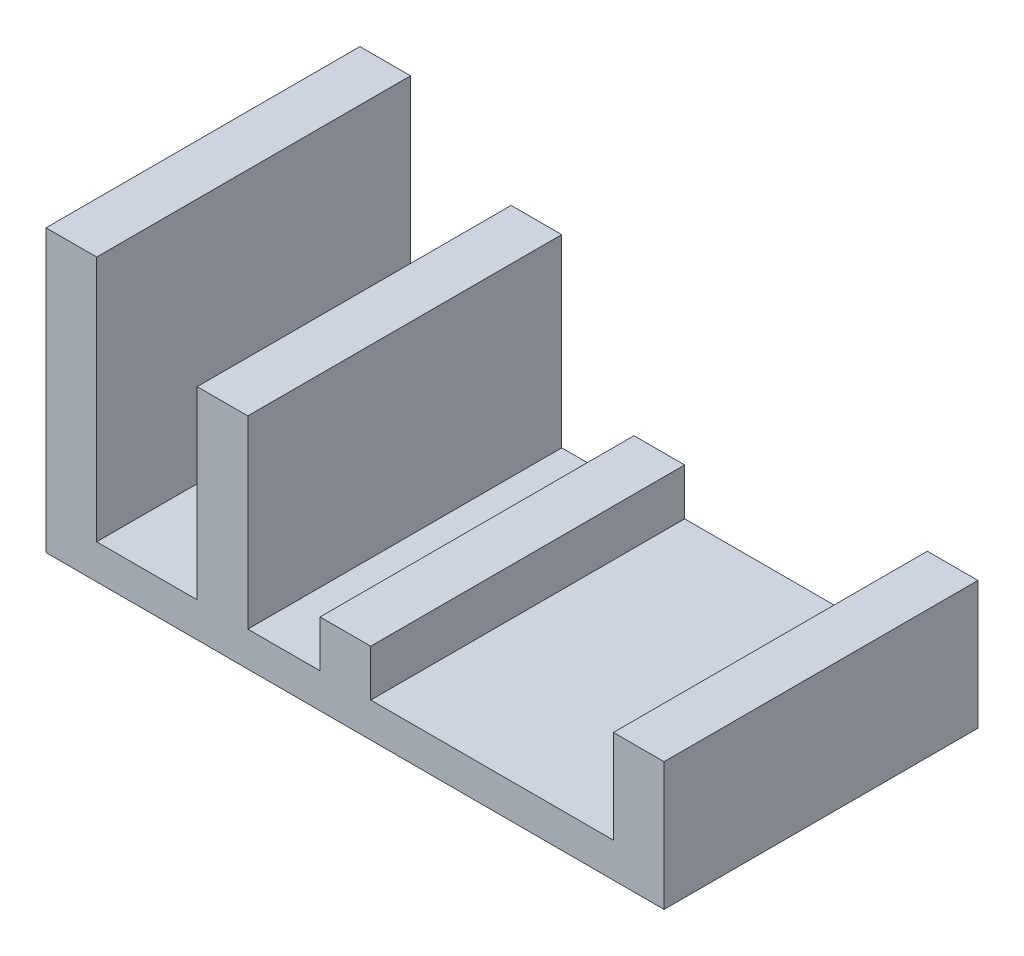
ISO-10303-21;
HEADER;
FILE_DESCRIPTION(('STEP AP214'),'2;1');
FILE_NAME('part.step','',(''),(''),'','','');
FILE_SCHEMA(('AUTOMOTIVE_DESIGN { 1 0 10303 214 1 1 1 1 }'));
ENDSEC;
DATA;
#1=APPLICATION_CONTEXT('core data for automotive mechanical design processes');
#2=APPLICATION_PROTOCOL_DEFINITION('international standard','automotive_design',2000,#1);
#3=PRODUCT_CONTEXT('',#1,'mechanical');
#4=PRODUCT('Part','Part','',(#3));
#5=PRODUCT_RELATED_PRODUCT_CATEGORY('part','',(#4));
#6=PRODUCT_DEFINITION_FORMATION('','',#4);
#7=PRODUCT_DEFINITION_CONTEXT('part definition',#1,'design');
#8=PRODUCT_DEFINITION('design','',#6,#7);
#9=PRODUCT_DEFINITION_SHAPE('','',#8);
#10=(LENGTH_UNIT() NAMED_UNIT(*) SI_UNIT(.MILLI.,.METRE.));
#11=(NAMED_UNIT(*) PLANE_ANGLE_UNIT() SI_UNIT($,.RADIAN.));
#12=(NAMED_UNIT(*) SI_UNIT($,.STERADIAN.) SOLID_ANGLE_UNIT());
#13=UNCERTAINTY_MEASURE_WITH_UNIT(LENGTH_MEASURE(1.E-05),#10,'distance_accuracy_value','');
#14=(GEOMETRIC_REPRESENTATION_CONTEXT(3) GLOBAL_UNCERTAINTY_ASSIGNED_CONTEXT((#13)) GLOBAL_UNIT_ASSIGNED_CONTEXT((#10,
#11,#12)) REPRESENTATION_CONTEXT('',''));
#15=CARTESIAN_POINT('',(0.,0.,0.));
#16=DIRECTION('',(0.,0.,1.));
#17=DIRECTION('',(1.,0.,0.));
#18=AXIS2_PLACEMENT_3D('',#15,#16,#17);
#19=CARTESIAN_POINT('',(12.1527001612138,67.4845492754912,37.6594941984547));
#20=DIRECTION('',(0.,-1.,0.));
#21=DIRECTION('',(0.,0.,-1.));
#22=AXIS2_PLACEMENT_3D('',#19,#20,#21);
#23=PLANE('',#22);
#24=DIRECTION('',(-1.,0.,0.));
#25=VECTOR('',#24,1.);
#26=CARTESIAN_POINT('',(12.1527001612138,67.4845492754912,-37.6594941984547));
#27=LINE('',#26,#25);
#28=CARTESIAN_POINT('',(12.1527001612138,67.4845492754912,-37.6594941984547));
#29=VERTEX_POINT('',#28);
#30=CARTESIAN_POINT('',(0.,67.4845492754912,-37.6594941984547));
#31=VERTEX_POINT('',#30);
#32=EDGE_CURVE('E148',#29,#31,#27,.T.);
#33=ORIENTED_EDGE('',*,*,#32,.T.);
#34=DIRECTION('',(0.,0.,-1.));
#35=VECTOR('',#34,1.);
#36=CARTESIAN_POINT('',(0.,67.4845492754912,37.6594941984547));
#37=LINE('',#36,#35);
#38=CARTESIAN_POINT('',(0.,67.4845492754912,37.6594941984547));
#39=VERTEX_POINT('',#38);
#40=EDGE_CURVE('E11',#39,#31,#37,.T.);
#41=ORIENTED_EDGE('',*,*,#40,.F.);
#42=DIRECTION('',(-1.,0.,0.));
#43=VECTOR('',#42,1.);
#44=CARTESIAN_POINT('',(12.1527001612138,67.4845492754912,37.6594941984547));
#45=LINE('',#44,#43);
#46=CARTESIAN_POINT('',(12.1527001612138,67.4845492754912,37.6594941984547));
#47=VERTEX_POINT('',#46);
#48=EDGE_CURVE('E191',#47,#39,#45,.T.);
#49=ORIENTED_EDGE('',*,*,#48,.F.);
#50=DIRECTION('',(0.,0.,-1.));
#51=VECTOR('',#50,1.);
#52=CARTESIAN_POINT('',(12.1527001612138,67.4845492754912,37.6594941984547));
#53=LINE('',#52,#51);
#54=EDGE_CURVE('E161',#47,#29,#53,.T.);
#55=ORIENTED_EDGE('',*,*,#54,.T.);
#56=EDGE_LOOP('',(#33,#41,#49,#55));
#57=FACE_BOUND('',#56,.T.);
#58=ADVANCED_FACE('F32',(#57),#23,.F.);
#59=CARTESIAN_POINT('',(0.,67.4845492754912,37.6594941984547));
#60=DIRECTION('',(1.,0.,0.));
#61=DIRECTION('',(0.,0.,-1.));
#62=AXIS2_PLACEMENT_3D('',#59,#60,#61);
#63=PLANE('',#62);
#64=DIRECTION('',(0.,-1.,0.));
#65=VECTOR('',#64,1.);
#66=CARTESIAN_POINT('',(0.,67.4845492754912,-37.6594941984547));
#67=LINE('',#66,#65);
#68=CARTESIAN_POINT('',(0.,0.,-37.6594941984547));
#69=VERTEX_POINT('',#68);
#70=EDGE_CURVE('E144',#31,#69,#67,.T.);
#71=ORIENTED_EDGE('',*,*,#70,.T.);
#72=DIRECTION('',(0.,0.,-1.));
#73=VECTOR('',#72,1.);
#74=CARTESIAN_POINT('',(0.,0.,37.6594941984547));
#75=LINE('',#74,#73);
#76=CARTESIAN_POINT('',(0.,0.,37.6594941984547));
#77=VERTEX_POINT('',#76);
#78=EDGE_CURVE('E39',#77,#69,#75,.T.);
#79=ORIENTED_EDGE('',*,*,#78,.F.);
#80=DIRECTION('',(0.,-1.,0.));
#81=VECTOR('',#80,1.);
#82=CARTESIAN_POINT('',(0.,67.4845492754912,37.6594941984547));
#83=LINE('',#82,#81);
#84=EDGE_CURVE('E157',#39,#77,#83,.T.);
#85=ORIENTED_EDGE('',*,*,#84,.F.);
#86=ORIENTED_EDGE('',*,*,#40,.T.);
#87=EDGE_LOOP('',(#71,#79,#85,#86));
#88=FACE_BOUND('',#87,.T.);
#89=ADVANCED_FACE('F156',(#88),#63,.F.);
#90=CARTESIAN_POINT('',(0.,0.,37.6594941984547));
#91=DIRECTION('',(0.,1.,0.));
#92=DIRECTION('',(0.,0.,1.));
#93=AXIS2_PLACEMENT_3D('',#90,#91,#92);
#94=PLANE('',#93);
#95=DIRECTION('',(1.,0.,0.));
#96=VECTOR('',#95,1.);
#97=CARTESIAN_POINT('',(0.,0.,-37.6594941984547));
#98=LINE('',#97,#96);
#99=CARTESIAN_POINT('',(148.290313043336,0.,-37.6594941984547));
#100=VERTEX_POINT('',#99);
#101=EDGE_CURVE('E150',#69,#100,#98,.T.);
#102=ORIENTED_EDGE('',*,*,#101,.T.);
#103=DIRECTION('',(0.,0.,-1.));
#104=VECTOR('',#103,1.);
#105=CARTESIAN_POINT('',(148.290313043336,0.,37.6594941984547));
#106=LINE('',#105,#104);
#107=CARTESIAN_POINT('',(148.290313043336,0.,37.6594941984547));
#108=VERTEX_POINT('',#107);
#109=EDGE_CURVE('E257',#108,#100,#106,.T.);
#110=ORIENTED_EDGE('',*,*,#109,.F.);
#111=DIRECTION('',(1.,0.,0.));
#112=VECTOR('',#111,1.);
#113=CARTESIAN_POINT('',(0.,0.,37.6594941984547));
#114=LINE('',#113,#112);
#115=EDGE_CURVE('E194',#77,#108,#114,.T.);
#116=ORIENTED_EDGE('',*,*,#115,.F.);
#117=ORIENTED_EDGE('',*,*,#78,.T.);
#118=EDGE_LOOP('',(#102,#110,#116,#117));
#119=FACE_BOUND('',#118,.T.);
#120=ADVANCED_FACE('F261',(#119),#94,.F.);
#121=CARTESIAN_POINT('',(148.290313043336,0.,37.6594941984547));
#122=DIRECTION('',(-1.,0.,0.));
#123=DIRECTION('',(0.,0.,1.));
#124=AXIS2_PLACEMENT_3D('',#121,#122,#123);
#125=PLANE('',#124);
#126=DIRECTION('',(0.,1.,0.));
#127=VECTOR('',#126,1.);
#128=CARTESIAN_POINT('',(148.290313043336,0.,-37.6594941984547));
#129=LINE('',#128,#127);
#130=CARTESIAN_POINT('',(148.290313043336,30.7015583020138,-37.6594941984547));
#131=VERTEX_POINT('',#130);
#132=EDGE_CURVE('E165',#100,#131,#129,.T.);
#133=ORIENTED_EDGE('',*,*,#132,.T.);
#134=DIRECTION('',(0.,0.,-1.));
#135=VECTOR('',#134,1.);
#136=CARTESIAN_POINT('',(148.290313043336,30.7015583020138,37.6594941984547));
#137=LINE('',#136,#135);
#138=CARTESIAN_POINT('',(148.290313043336,30.7015583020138,37.6594941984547));
#139=VERTEX_POINT('',#138);
#140=EDGE_CURVE('E254',#139,#131,#137,.T.);
#141=ORIENTED_EDGE('',*,*,#140,.F.);
#142=DIRECTION('',(0.,1.,0.));
#143=VECTOR('',#142,1.);
#144=CARTESIAN_POINT('',(148.290313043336,0.,37.6594941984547));
#145=LINE('',#144,#143);
#146=EDGE_CURVE('E196',#108,#139,#145,.T.);
#147=ORIENTED_EDGE('',*,*,#146,.F.);
#148=ORIENTED_EDGE('',*,*,#109,.T.);
#149=EDGE_LOOP('',(#133,#141,#147,#148));
#150=FACE_BOUND('',#149,.T.);
#151=ADVANCED_FACE('F269',(#150),#125,.F.);
#152=CARTESIAN_POINT('',(148.290313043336,30.7015583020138,37.6594941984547));
#153=DIRECTION('',(0.,-1.,0.));
#154=DIRECTION('',(0.,0.,-1.));
#155=AXIS2_PLACEMENT_3D('',#152,#153,#154);
#156=PLANE('',#155);
#157=DIRECTION('',(-1.,0.,0.));
#158=VECTOR('',#157,1.);
#159=CARTESIAN_POINT('',(148.290313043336,30.7015583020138,-37.6594941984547));
#160=LINE('',#159,#158);
#161=CARTESIAN_POINT('',(136.137612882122,30.7015583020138,-37.6594941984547));
#162=VERTEX_POINT('',#161);
#163=EDGE_CURVE('E167',#131,#162,#160,.T.);
#164=ORIENTED_EDGE('',*,*,#163,.T.);
#165=DIRECTION('',(0.,0.,-1.));
#166=VECTOR('',#165,1.);
#167=CARTESIAN_POINT('',(136.137612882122,30.7015583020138,37.6594941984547));
#168=LINE('',#167,#166);
#169=CARTESIAN_POINT('',(136.137612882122,30.7015583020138,37.6594941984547));
#170=VERTEX_POINT('',#169);
#171=EDGE_CURVE('E251',#170,#162,#168,.T.);
#172=ORIENTED_EDGE('',*,*,#171,.F.);
#173=DIRECTION('',(-1.,0.,0.));
#174=VECTOR('',#173,1.);
#175=CARTESIAN_POINT('',(148.290313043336,30.7015583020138,37.6594941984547));
#176=LINE('',#175,#174);
#177=EDGE_CURVE('E198',#139,#170,#176,.T.);
#178=ORIENTED_EDGE('',*,*,#177,.F.);
#179=ORIENTED_EDGE('',*,*,#140,.T.);
#180=EDGE_LOOP('',(#164,#172,#178,#179));
#181=FACE_BOUND('',#180,.T.);
#182=ADVANCED_FACE('F272',(#181),#156,.F.);
#183=CARTESIAN_POINT('',(136.137612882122,30.7015583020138,37.6594941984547));
#184=DIRECTION('',(1.,0.,0.));
#185=DIRECTION('',(0.,0.,-1.));
#186=AXIS2_PLACEMENT_3D('',#183,#184,#185);
#187=PLANE('',#186);
#188=DIRECTION('',(0.,-1.,0.));
#189=VECTOR('',#188,1.);
#190=CARTESIAN_POINT('',(136.137612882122,30.7015583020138,-37.6594941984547));
#191=LINE('',#190,#189);
#192=CARTESIAN_POINT('',(136.137612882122,8.31500537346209,-37.6594941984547));
#193=VERTEX_POINT('',#192);
#194=EDGE_CURVE('E169',#162,#193,#191,.T.);
#195=ORIENTED_EDGE('',*,*,#194,.T.);
#196=DIRECTION('',(0.,0.,-1.));
#197=VECTOR('',#196,1.);
#198=CARTESIAN_POINT('',(136.137612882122,8.31500537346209,37.6594941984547));
#199=LINE('',#198,#197);
#200=CARTESIAN_POINT('',(136.137612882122,8.31500537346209,37.6594941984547));
#201=VERTEX_POINT('',#200);
#202=EDGE_CURVE('E248',#201,#193,#199,.T.);
#203=ORIENTED_EDGE('',*,*,#202,.F.);
#204=DIRECTION('',(0.,-1.,0.));
#205=VECTOR('',#204,1.);
#206=CARTESIAN_POINT('',(136.137612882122,30.7015583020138,37.6594941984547));
#207=LINE('',#206,#205);
#208=EDGE_CURVE('E200',#170,#201,#207,.T.);
#209=ORIENTED_EDGE('',*,*,#208,.F.);
#210=ORIENTED_EDGE('',*,*,#171,.T.);
#211=EDGE_LOOP('',(#195,#203,#209,#210));
#212=FACE_BOUND('',#211,.T.);
#213=ADVANCED_FACE('F277',(#212),#187,.F.);
#214=CARTESIAN_POINT('',(136.137612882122,8.31500537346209,37.6594941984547));
#215=DIRECTION('',(0.,-1.,0.));
#216=DIRECTION('',(1.,0.,0.));
#217=AXIS2_PLACEMENT_3D('',#214,#215,#216);
#218=PLANE('',#217);
#219=DIRECTION('',(-1.,0.,0.));
#220=VECTOR('',#219,1.);
#221=CARTESIAN_POINT('',(136.137612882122,8.31500537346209,-37.6594941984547));
#222=LINE('',#221,#220);
#223=CARTESIAN_POINT('',(77.9104355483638,8.31500537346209,-37.6594941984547));
#224=VERTEX_POINT('',#223);
#225=EDGE_CURVE('E171',#193,#224,#222,.T.);
#226=ORIENTED_EDGE('',*,*,#225,.T.);
#227=DIRECTION('',(0.,0.,-1.));
#228=VECTOR('',#227,1.);
#229=CARTESIAN_POINT('',(77.9104355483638,8.31500537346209,37.6594941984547));
#230=LINE('',#229,#228);
#231=CARTESIAN_POINT('',(77.9104355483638,8.31500537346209,37.6594941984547));
#232=VERTEX_POINT('',#231);
#233=EDGE_CURVE('E245',#232,#224,#230,.T.);
#234=ORIENTED_EDGE('',*,*,#233,.F.);
#235=DIRECTION('',(-1.,0.,0.));
#236=VECTOR('',#235,1.);
#237=CARTESIAN_POINT('',(136.137612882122,8.31500537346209,37.6594941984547));
#238=LINE('',#237,#236);
#239=EDGE_CURVE('E202',#201,#232,#238,.T.);
#240=ORIENTED_EDGE('',*,*,#239,.F.);
#241=ORIENTED_EDGE('',*,*,#202,.T.);
#242=EDGE_LOOP('',(#226,#234,#240,#241));
#243=FACE_BOUND('',#242,.T.);
#244=ADVANCED_FACE('F283',(#243),#218,.F.);
#245=CARTESIAN_POINT('',(77.9104355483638,8.31500537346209,37.6594941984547));
#246=DIRECTION('',(-1.,0.,0.));
#247=DIRECTION('',(0.,0.,1.));
#248=AXIS2_PLACEMENT_3D('',#245,#246,#247);
#249=PLANE('',#248);
#250=DIRECTION('',(0.,1.,0.));
#251=VECTOR('',#250,1.);
#252=CARTESIAN_POINT('',(77.9104355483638,8.31500537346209,-37.6594941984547));
#253=LINE('',#252,#251);
#254=CARTESIAN_POINT('',(77.9104355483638,19.5082818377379,-37.6594941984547));
#255=VERTEX_POINT('',#254);
#256=EDGE_CURVE('E173',#224,#255,#253,.T.);
#257=ORIENTED_EDGE('',*,*,#256,.T.);
#258=DIRECTION('',(0.,0.,-1.));
#259=VECTOR('',#258,1.);
#260=CARTESIAN_POINT('',(77.9104355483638,19.5082818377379,37.6594941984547));
#261=LINE('',#260,#259);
#262=CARTESIAN_POINT('',(77.9104355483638,19.5082818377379,37.6594941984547));
#263=VERTEX_POINT('',#262);
#264=EDGE_CURVE('E242',#263,#255,#261,.T.);
#265=ORIENTED_EDGE('',*,*,#264,.F.);
#266=DIRECTION('',(0.,1.,0.));
#267=VECTOR('',#266,1.);
#268=CARTESIAN_POINT('',(77.9104355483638,8.31500537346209,37.6594941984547));
#269=LINE('',#268,#267);
#270=EDGE_CURVE('E204',#232,#263,#269,.T.);
#271=ORIENTED_EDGE('',*,*,#270,.F.);
#272=ORIENTED_EDGE('',*,*,#233,.T.);
#273=EDGE_LOOP('',(#257,#265,#271,#272));
#274=FACE_BOUND('',#273,.T.);
#275=ADVANCED_FACE('F287',(#274),#249,.F.);
#276=CARTESIAN_POINT('',(77.9104355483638,19.5082818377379,37.6594941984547));
#277=DIRECTION('',(0.,-1.,0.));
#278=DIRECTION('',(0.,0.,-1.));
#279=AXIS2_PLACEMENT_3D('',#276,#277,#278);
#280=PLANE('',#279);
#281=DIRECTION('',(-1.,0.,0.));
#282=VECTOR('',#281,1.);
#283=CARTESIAN_POINT('',(77.9104355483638,19.5082818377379,-37.6594941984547));
#284=LINE('',#283,#282);
#285=CARTESIAN_POINT('',(65.75773538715,19.5082818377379,-37.6594941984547));
#286=VERTEX_POINT('',#285);
#287=EDGE_CURVE('E175',#255,#286,#284,.T.);
#288=ORIENTED_EDGE('',*,*,#287,.T.);
#289=DIRECTION('',(0.,0.,-1.));
#290=VECTOR('',#289,1.);
#291=CARTESIAN_POINT('',(65.75773538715,19.5082818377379,37.6594941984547));
#292=LINE('',#291,#290);
#293=CARTESIAN_POINT('',(65.75773538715,19.5082818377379,37.6594941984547));
#294=VERTEX_POINT('',#293);
#295=EDGE_CURVE('E239',#294,#286,#292,.T.);
#296=ORIENTED_EDGE('',*,*,#295,.F.);
#297=DIRECTION('',(-1.,0.,0.));
#298=VECTOR('',#297,1.);
#299=CARTESIAN_POINT('',(77.9104355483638,19.5082818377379,37.6594941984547));
#300=LINE('',#299,#298);
#301=EDGE_CURVE('E206',#263,#294,#300,.T.);
#302=ORIENTED_EDGE('',*,*,#301,.F.);
#303=ORIENTED_EDGE('',*,*,#264,.T.);
#304=EDGE_LOOP('',(#288,#296,#302,#303));
#305=FACE_BOUND('',#304,.T.);
#306=ADVANCED_FACE('F292',(#305),#280,.F.);
#307=CARTESIAN_POINT('',(65.75773538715,19.5082818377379,37.6594941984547));
#308=DIRECTION('',(1.,0.,0.));
#309=DIRECTION('',(0.,0.,-1.));
#310=AXIS2_PLACEMENT_3D('',#307,#308,#309);
#311=PLANE('',#310);
#312=DIRECTION('',(0.,-1.,0.));
#313=VECTOR('',#312,1.);
#314=CARTESIAN_POINT('',(65.75773538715,19.5082818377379,-37.6594941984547));
#315=LINE('',#314,#313);
#316=CARTESIAN_POINT('',(65.75773538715,8.31500537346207,-37.6594941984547));
#317=VERTEX_POINT('',#316);
#318=EDGE_CURVE('E177',#286,#317,#315,.T.);
#319=ORIENTED_EDGE('',*,*,#318,.T.);
#320=DIRECTION('',(0.,0.,-1.));
#321=VECTOR('',#320,1.);
#322=CARTESIAN_POINT('',(65.75773538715,8.31500537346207,37.6594941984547));
#323=LINE('',#322,#321);
#324=CARTESIAN_POINT('',(65.75773538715,8.31500537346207,37.6594941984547));
#325=VERTEX_POINT('',#324);
#326=EDGE_CURVE('E236',#325,#317,#323,.T.);
#327=ORIENTED_EDGE('',*,*,#326,.F.);
#328=DIRECTION('',(0.,-1.,0.));
#329=VECTOR('',#328,1.);
#330=CARTESIAN_POINT('',(65.75773538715,19.5082818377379,37.6594941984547));
#331=LINE('',#330,#329);
#332=EDGE_CURVE('E208',#294,#325,#331,.T.);
#333=ORIENTED_EDGE('',*,*,#332,.F.);
#334=ORIENTED_EDGE('',*,*,#295,.T.);
#335=EDGE_LOOP('',(#319,#327,#333,#334));
#336=FACE_BOUND('',#335,.T.);
#337=ADVANCED_FACE('F298',(#336),#311,.F.);
#338=CARTESIAN_POINT('',(65.75773538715,8.31500537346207,37.6594941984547));
#339=DIRECTION('',(0.,-1.,0.));
#340=DIRECTION('',(0.,0.,-1.));
#341=AXIS2_PLACEMENT_3D('',#338,#339,#340);
#342=PLANE('',#341);
#343=DIRECTION('',(-1.,0.,0.));
#344=VECTOR('',#343,1.);
#345=CARTESIAN_POINT('',(65.75773538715,8.31500537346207,-37.6594941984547));
#346=LINE('',#345,#344);
#347=CARTESIAN_POINT('',(48.4216600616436,8.31500537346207,-37.6594941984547));
#348=VERTEX_POINT('',#347);
#349=EDGE_CURVE('E179',#317,#348,#346,.T.);
#350=ORIENTED_EDGE('',*,*,#349,.T.);
#351=DIRECTION('',(0.,0.,-1.));
#352=VECTOR('',#351,1.);
#353=CARTESIAN_POINT('',(48.4216600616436,8.31500537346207,37.6594941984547));
#354=LINE('',#353,#352);
#355=CARTESIAN_POINT('',(48.4216600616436,8.31500537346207,37.6594941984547));
#356=VERTEX_POINT('',#355);
#357=EDGE_CURVE('E233',#356,#348,#354,.T.);
#358=ORIENTED_EDGE('',*,*,#357,.F.);
#359=DIRECTION('',(-1.,0.,0.));
#360=VECTOR('',#359,1.);
#361=CARTESIAN_POINT('',(65.75773538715,8.31500537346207,37.6594941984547));
#362=LINE('',#361,#360);
#363=EDGE_CURVE('E210',#325,#356,#362,.T.);
#364=ORIENTED_EDGE('',*,*,#363,.F.);
#365=ORIENTED_EDGE('',*,*,#326,.T.);
#366=EDGE_LOOP('',(#350,#358,#364,#365));
#367=FACE_BOUND('',#366,.T.);
#368=ADVANCED_FACE('F302',(#367),#342,.F.);
#369=CARTESIAN_POINT('',(48.4216600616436,8.31500537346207,37.6594941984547));
#370=DIRECTION('',(-1.,0.,0.));
#371=DIRECTION('',(0.,0.,1.));
#372=AXIS2_PLACEMENT_3D('',#369,#370,#371);
#373=PLANE('',#372);
#374=DIRECTION('',(0.,1.,0.));
#375=VECTOR('',#374,1.);
#376=CARTESIAN_POINT('',(48.4216600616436,8.31500537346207,-37.6594941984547));
#377=LINE('',#376,#375);
#378=CARTESIAN_POINT('',(48.4216600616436,52.6143636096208,-37.6594941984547));
#379=VERTEX_POINT('',#378);
#380=EDGE_CURVE('E181',#348,#379,#377,.T.);
#381=ORIENTED_EDGE('',*,*,#380,.T.);
#382=DIRECTION('',(0.,0.,-1.));
#383=VECTOR('',#382,1.);
#384=CARTESIAN_POINT('',(48.4216600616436,52.6143636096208,37.6594941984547));
#385=LINE('',#384,#383);
#386=CARTESIAN_POINT('',(48.4216600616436,52.6143636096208,37.6594941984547));
#387=VERTEX_POINT('',#386);
#388=EDGE_CURVE('E230',#387,#379,#385,.T.);
#389=ORIENTED_EDGE('',*,*,#388,.F.);
#390=DIRECTION('',(0.,1.,0.));
#391=VECTOR('',#390,1.);
#392=CARTESIAN_POINT('',(48.4216600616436,8.31500537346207,37.6594941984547));
#393=LINE('',#392,#391);
#394=EDGE_CURVE('E212',#356,#387,#393,.T.);
#395=ORIENTED_EDGE('',*,*,#394,.F.);
#396=ORIENTED_EDGE('',*,*,#357,.T.);
#397=EDGE_LOOP('',(#381,#389,#395,#396));
#398=FACE_BOUND('',#397,.T.);
#399=ADVANCED_FACE('F307',(#398),#373,.F.);
#400=CARTESIAN_POINT('',(48.4216600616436,52.6143636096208,37.6594941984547));
#401=DIRECTION('',(0.,-1.,0.));
#402=DIRECTION('',(1.,0.,0.));
#403=AXIS2_PLACEMENT_3D('',#400,#401,#402);
#404=PLANE('',#403);
#405=DIRECTION('',(-1.,0.,0.));
#406=VECTOR('',#405,1.);
#407=CARTESIAN_POINT('',(48.4216600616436,52.6143636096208,-37.6594941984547));
#408=LINE('',#407,#406);
#409=CARTESIAN_POINT('',(36.2689599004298,52.6143636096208,-37.6594941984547));
#410=VERTEX_POINT('',#409);
#411=EDGE_CURVE('E183',#379,#410,#408,.T.);
#412=ORIENTED_EDGE('',*,*,#411,.T.);
#413=DIRECTION('',(0.,0.,-1.));
#414=VECTOR('',#413,1.);
#415=CARTESIAN_POINT('',(36.2689599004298,52.6143636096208,37.6594941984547));
#416=LINE('',#415,#414);
#417=CARTESIAN_POINT('',(36.2689599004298,52.6143636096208,37.6594941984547));
#418=VERTEX_POINT('',#417);
#419=EDGE_CURVE('E227',#418,#410,#416,.T.);
#420=ORIENTED_EDGE('',*,*,#419,.F.);
#421=DIRECTION('',(-1.,0.,0.));
#422=VECTOR('',#421,1.);
#423=CARTESIAN_POINT('',(48.4216600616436,52.6143636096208,37.6594941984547));
#424=LINE('',#423,#422);
#425=EDGE_CURVE('E214',#387,#418,#424,.T.);
#426=ORIENTED_EDGE('',*,*,#425,.F.);
#427=ORIENTED_EDGE('',*,*,#388,.T.);
#428=EDGE_LOOP('',(#412,#420,#426,#427));
#429=FACE_BOUND('',#428,.T.);
#430=ADVANCED_FACE('F313',(#429),#404,.F.);
#431=CARTESIAN_POINT('',(36.2689599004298,52.6143636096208,37.6594941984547));
#432=DIRECTION('',(1.,0.,0.));
#433=DIRECTION('',(0.,1.,0.));
#434=AXIS2_PLACEMENT_3D('',#431,#432,#433);
#435=PLANE('',#434);
#436=DIRECTION('',(0.,-1.,0.));
#437=VECTOR('',#436,1.);
#438=CARTESIAN_POINT('',(36.2689599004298,52.6143636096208,-37.6594941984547));
#439=LINE('',#438,#437);
#440=CARTESIAN_POINT('',(36.2689599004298,8.31500537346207,-37.6594941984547));
#441=VERTEX_POINT('',#440);
#442=EDGE_CURVE('E185',#410,#441,#439,.T.);
#443=ORIENTED_EDGE('',*,*,#442,.T.);
#444=DIRECTION('',(0.,0.,-1.));
#445=VECTOR('',#444,1.);
#446=CARTESIAN_POINT('',(36.2689599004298,8.31500537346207,37.6594941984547));
#447=LINE('',#446,#445);
#448=CARTESIAN_POINT('',(36.2689599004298,8.31500537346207,37.6594941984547));
#449=VERTEX_POINT('',#448);
#450=EDGE_CURVE('E224',#449,#441,#447,.T.);
#451=ORIENTED_EDGE('',*,*,#450,.F.);
#452=DIRECTION('',(0.,-1.,0.));
#453=VECTOR('',#452,1.);
#454=CARTESIAN_POINT('',(36.2689599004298,52.6143636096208,37.6594941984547));
#455=LINE('',#454,#453);
#456=EDGE_CURVE('E216',#418,#449,#455,.T.);
#457=ORIENTED_EDGE('',*,*,#456,.F.);
#458=ORIENTED_EDGE('',*,*,#419,.T.);
#459=EDGE_LOOP('',(#443,#451,#457,#458));
#460=FACE_BOUND('',#459,.T.);
#461=ADVANCED_FACE('F317',(#460),#435,.F.);
#462=CARTESIAN_POINT('',(36.2689599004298,8.31500537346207,37.6594941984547));
#463=DIRECTION('',(0.,-1.,0.));
#464=DIRECTION('',(0.,0.,-1.));
#465=AXIS2_PLACEMENT_3D('',#462,#463,#464);
#466=PLANE('',#465);
#467=DIRECTION('',(-1.,0.,0.));
#468=VECTOR('',#467,1.);
#469=CARTESIAN_POINT('',(36.2689599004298,8.31500537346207,-37.6594941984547));
#470=LINE('',#469,#468);
#471=CARTESIAN_POINT('',(12.1527001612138,8.31500537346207,-37.6594941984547));
#472=VERTEX_POINT('',#471);
#473=EDGE_CURVE('E187',#441,#472,#470,.T.);
#474=ORIENTED_EDGE('',*,*,#473,.T.);
#475=DIRECTION('',(0.,0.,-1.));
#476=VECTOR('',#475,1.);
#477=CARTESIAN_POINT('',(12.1527001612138,8.31500537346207,37.6594941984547));
#478=LINE('',#477,#476);
#479=CARTESIAN_POINT('',(12.1527001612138,8.31500537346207,37.6594941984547));
#480=VERTEX_POINT('',#479);
#481=EDGE_CURVE('E221',#480,#472,#478,.T.);
#482=ORIENTED_EDGE('',*,*,#481,.F.);
#483=DIRECTION('',(-1.,0.,0.));
#484=VECTOR('',#483,1.);
#485=CARTESIAN_POINT('',(36.2689599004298,8.31500537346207,37.6594941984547));
#486=LINE('',#485,#484);
#487=EDGE_CURVE('E51',#449,#480,#486,.T.);
#488=ORIENTED_EDGE('',*,*,#487,.F.);
#489=ORIENTED_EDGE('',*,*,#450,.T.);
#490=EDGE_LOOP('',(#474,#482,#488,#489));
#491=FACE_BOUND('',#490,.T.);
#492=ADVANCED_FACE('F320',(#491),#466,.F.);
#493=CARTESIAN_POINT('',(12.1527001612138,8.31500537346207,37.6594941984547));
#494=DIRECTION('',(-1.,0.,0.));
#495=DIRECTION('',(0.,0.,1.));
#496=AXIS2_PLACEMENT_3D('',#493,#494,#495);
#497=PLANE('',#496);
#498=DIRECTION('',(0.,1.,0.));
#499=VECTOR('',#498,1.);
#500=CARTESIAN_POINT('',(12.1527001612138,8.31500537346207,-37.6594941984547));
#501=LINE('',#500,#499);
#502=EDGE_CURVE('E189',#472,#29,#501,.T.);
#503=ORIENTED_EDGE('',*,*,#502,.T.);
#504=ORIENTED_EDGE('',*,*,#54,.F.);
#505=DIRECTION('',(0.,1.,0.));
#506=VECTOR('',#505,1.);
#507=CARTESIAN_POINT('',(12.1527001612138,8.31500537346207,37.6594941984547));
#508=LINE('',#507,#506);
#509=EDGE_CURVE('E46',#480,#47,#508,.T.);
#510=ORIENTED_EDGE('',*,*,#509,.F.);
#511=ORIENTED_EDGE('',*,*,#481,.T.);
#512=EDGE_LOOP('',(#503,#504,#510,#511));
#513=FACE_BOUND('',#512,.T.);
#514=ADVANCED_FACE('F322',(#513),#497,.F.);
#515=CARTESIAN_POINT('',(0.,67.4845492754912,37.6594941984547));
#516=DIRECTION('',(0.,0.,1.));
#517=DIRECTION('',(1.,0.,0.));
#518=AXIS2_PLACEMENT_3D('',#515,#516,#517);
#519=PLANE('',#518);
#520=ORIENTED_EDGE('',*,*,#48,.T.);
#521=ORIENTED_EDGE('',*,*,#84,.T.);
#522=ORIENTED_EDGE('',*,*,#115,.T.);
#523=ORIENTED_EDGE('',*,*,#146,.T.);
#524=ORIENTED_EDGE('',*,*,#177,.T.);
#525=ORIENTED_EDGE('',*,*,#208,.T.);
#526=ORIENTED_EDGE('',*,*,#239,.T.);
#527=ORIENTED_EDGE('',*,*,#270,.T.);
#528=ORIENTED_EDGE('',*,*,#301,.T.);
#529=ORIENTED_EDGE('',*,*,#332,.T.);
#530=ORIENTED_EDGE('',*,*,#363,.T.);
#531=ORIENTED_EDGE('',*,*,#394,.T.);
#532=ORIENTED_EDGE('',*,*,#425,.T.);
#533=ORIENTED_EDGE('',*,*,#456,.T.);
#534=ORIENTED_EDGE('',*,*,#487,.T.);
#535=ORIENTED_EDGE('',*,*,#509,.T.);
#536=EDGE_LOOP('',(#520,#521,#522,#523,#524,#525,#526,#527,#528,#529,#530,#531,#532,#533,#534,#535));
#537=FACE_BOUND('',#536,.T.);
#538=ADVANCED_FACE('F264',(#537),#519,.T.);
#539=CARTESIAN_POINT('',(0.,67.4845492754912,-37.6594941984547));
#540=DIRECTION('',(0.,0.,1.));
#541=DIRECTION('',(1.,0.,0.));
#542=AXIS2_PLACEMENT_3D('',#539,#540,#541);
#543=PLANE('',#542);
#544=ORIENTED_EDGE('',*,*,#32,.F.);
#545=ORIENTED_EDGE('',*,*,#502,.F.);
#546=ORIENTED_EDGE('',*,*,#473,.F.);
#547=ORIENTED_EDGE('',*,*,#442,.F.);
#548=ORIENTED_EDGE('',*,*,#411,.F.);
#549=ORIENTED_EDGE('',*,*,#380,.F.);
#550=ORIENTED_EDGE('',*,*,#349,.F.);
#551=ORIENTED_EDGE('',*,*,#318,.F.);
#552=ORIENTED_EDGE('',*,*,#287,.F.);
#553=ORIENTED_EDGE('',*,*,#256,.F.);
#554=ORIENTED_EDGE('',*,*,#225,.F.);
#555=ORIENTED_EDGE('',*,*,#194,.F.);
#556=ORIENTED_EDGE('',*,*,#163,.F.);
#557=ORIENTED_EDGE('',*,*,#132,.F.);
#558=ORIENTED_EDGE('',*,*,#101,.F.);
#559=ORIENTED_EDGE('',*,*,#70,.F.);
#560=EDGE_LOOP('',(#544,#545,#546,#547,#548,#549,#550,#551,#552,#553,#554,#555,#556,#557,#558,#559));
#561=FACE_BOUND('',#560,.T.);
#562=ADVANCED_FACE('F145',(#561),#543,.F.);
#563=CLOSED_SHELL('',(#58,#89,#120,#151,#182,#213,#244,#275,#306,#337,#368,#399,#430,#461,#492,
#514,#538,#562));
#564=MANIFOLD_SOLID_BREP('B2',#563);
#565=ADVANCED_BREP_SHAPE_REPRESENTATION('',(#18,#564),#14);
#566=SHAPE_DEFINITION_REPRESENTATION(#9,#565);
ENDSEC;
END-ISO-10303-21;
